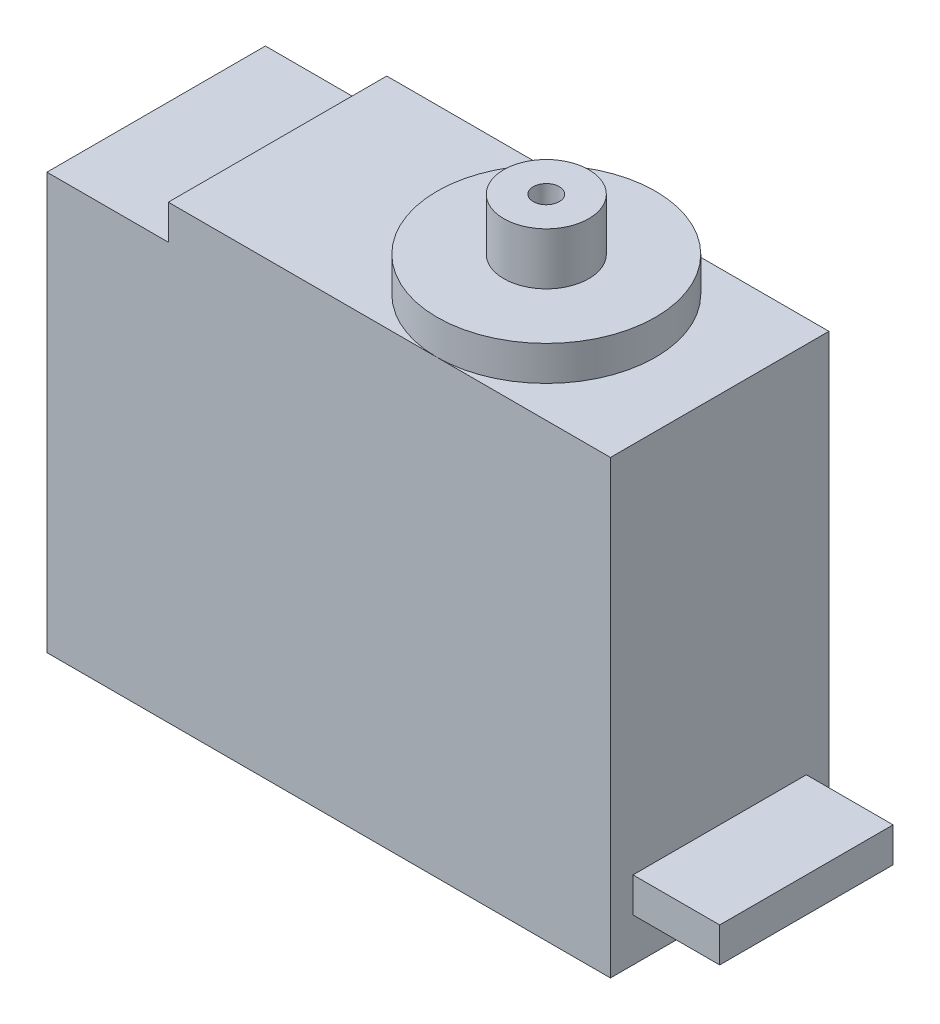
from build123d import *

# Parameters (mm, degrees)
SKETCH1_W           = 32.5
SKETCH1_H           = 12.6
BOSS_EXTRUDE1_DEPTH = 24
SKETCH2_W           = 25.5
SKETCH2_H           = 12.6
BOSS_EXTRUDE2_DEPTH = 2
SKETCH3_R           = 6.3
BOSS_EXTRUDE3_DEPTH = 2
SKETCH4_R           = 2.45
BOSS_EXTRUDE4_DEPTH = 3
SKETCH5_R           = 0.75
CUT_EXTRUDE1_DEPTH  = 3
SKETCH6_W           = 10
SKETCH6_H           = 2
BOSS_EXTRUDE5_DEPTH = 5


with BuildPart() as part:
    # Sketch1 → Boss-Extrude1 (new body)
    with BuildSketch(Plane(origin=(0, 0, 0), x_dir=(1, 0, 0), z_dir=(0, 1, 0))):
        with Locations((-16.25, 6.3)):
            Rectangle(SKETCH1_W, SKETCH1_H)
    extrude(amount=BOSS_EXTRUDE1_DEPTH)

    # Sketch2 → Boss-Extrude2 (add)
    with BuildSketch(Plane(origin=(0, 24, 0), x_dir=(1, 0, 0), z_dir=(0, 1, 0))):
        with Locations((-12.75, 6.3)):
            Rectangle(SKETCH2_W, SKETCH2_H)
    extrude(amount=BOSS_EXTRUDE2_DEPTH)

    # Sketch3 → Boss-Extrude3 (add)
    with BuildSketch(Plane(origin=(0, 26, 0), x_dir=(1, 0, 0), z_dir=(0, 1, 0))):
        with Locations(Location((-10, 6.3, 0), (0, 0, 270))):
            Circle(SKETCH3_R)
    extrude(amount=BOSS_EXTRUDE3_DEPTH)

    # Sketch4 → Boss-Extrude4 (add)
    with BuildSketch(Plane(origin=(0, 28, 0), x_dir=(1, 0, 0), z_dir=(0, 1, 0))):
        with Locations(Location((-10, 6.3, 0), (0, 0, 270))):
            Circle(SKETCH4_R)
    extrude(amount=BOSS_EXTRUDE4_DEPTH)

    # Sketch5 → Cut-Extrude1 (cut)
    with BuildSketch(Plane(origin=(0, 31, 0), x_dir=(1, 0, 0), z_dir=(0, 1, 0))):
        with Locations(Location((-10, 6.3, 0), (0, 0, 270))):
            Circle(SKETCH5_R)
    extrude(amount=-CUT_EXTRUDE1_DEPTH, mode=Mode.SUBTRACT)

    # Sketch6 → Boss-Extrude5 (add)
    with BuildSketch(Plane(origin=(0, 0, 0), x_dir=(0, 0, -1), z_dir=(1, 0, 0))):
        with Locations((6.3, 3.5)):
            Rectangle(SKETCH6_W, SKETCH6_H)
    extrude(amount=BOSS_EXTRUDE5_DEPTH)


solid = part.part
